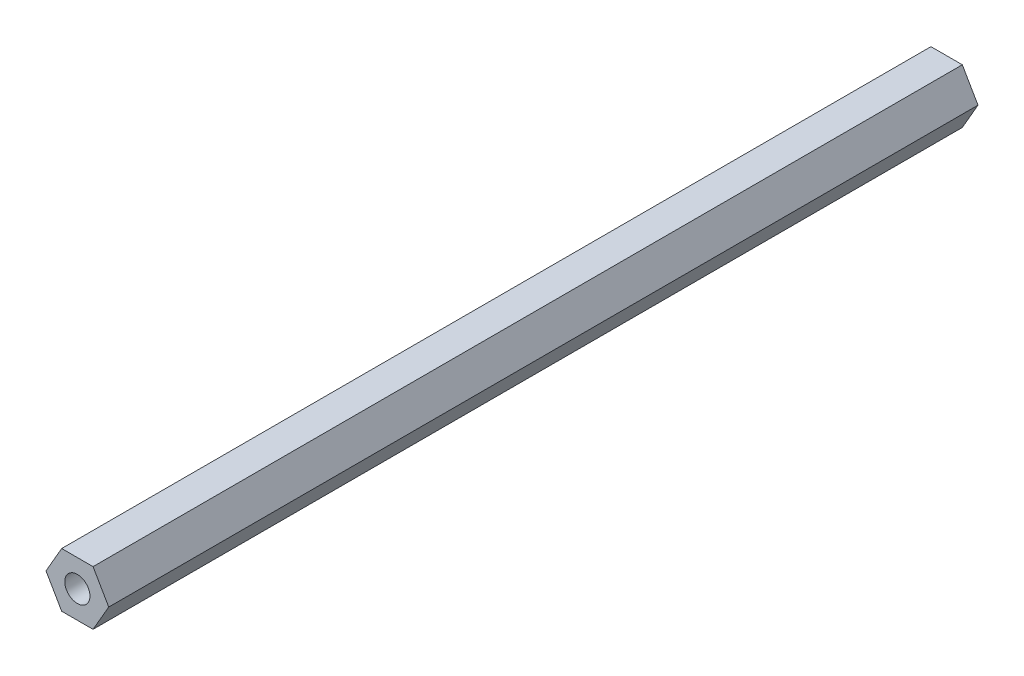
from build123d import *

# Parameters (mm, degrees)
BOSS_EXTRUDE1_DEPTH   = 101.6
F_4_CLEARANCE_HOLE1_D = 2.9464


with BuildPart() as part:
    # Sketch1 → Boss-Extrude1 (new body)
    with BuildSketch(Plane.XY):
        Polygon((1.833087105, 3.175), (-1.833087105, 3.175), (-3.666174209, 0), (-1.833087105, -3.175), (1.833087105, -3.175), (3.666174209, 0), align=None)
    extrude(amount=BOSS_EXTRUDE1_DEPTH)

    # 4 Clearance Hole1 (through all)
    with Locations(Plane.XY.offset(101.6)):
        with Locations((0, 0)):
            Hole(F_4_CLEARANCE_HOLE1_D / 2)


solid = part.part
